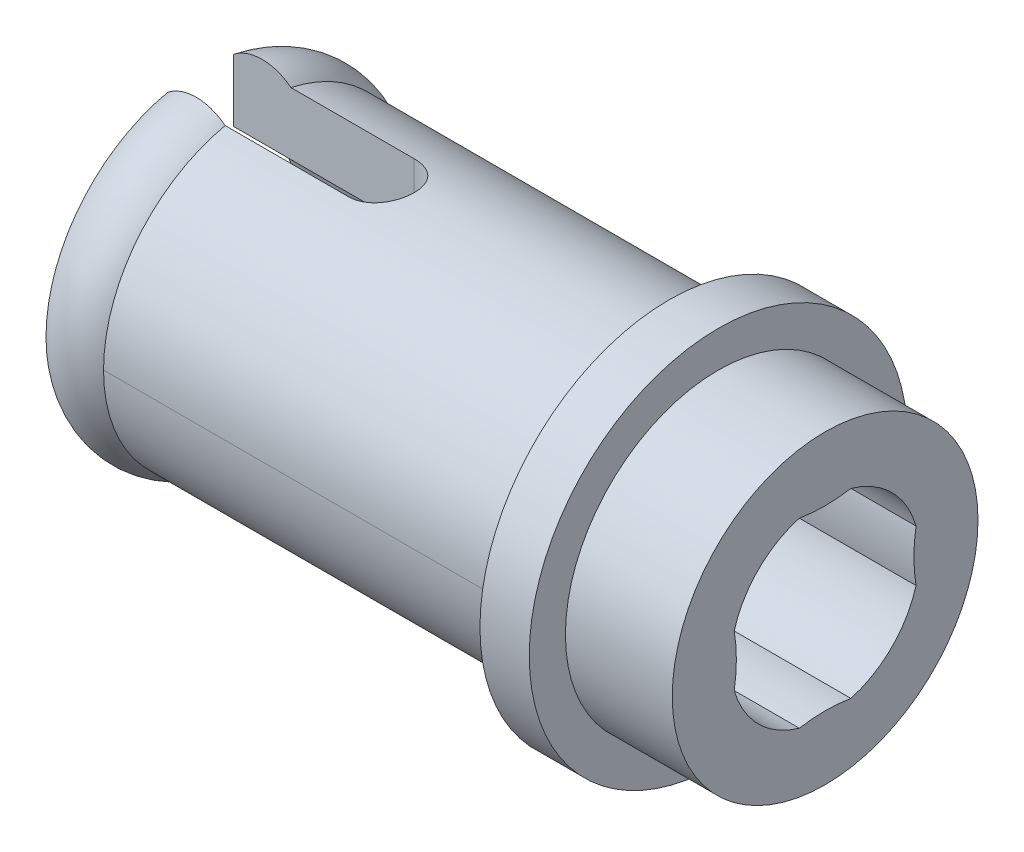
from build123d import *

# Parameters (mm, degrees)
SKETCH1_R               = 2.3622
BASE_EXTRUDE_DEPTH      = 1.651
SKETCH3_R               = 2.921
BOSS_EXTRUDE1_DEPTH     = 0.762
SKETCH4_R               = 2.3876
BOSS_EXTRUDE2_DEPTH     = 7.239
SKETCH7_R               = 1.4605
CUT_EXTRUDE2_DEPTH      = 11.498837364
CUT_EXTRUDE4_DEPTH      = 10.004470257
CUT_EXTRUDE4_DEPTH_BACK = 10.004470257
BOSS_EXTRUDE11_START    = -3.937
BOSS_EXTRUDE11_DEPTH    = 3.937
CIRPATTERN1_COUNT       = 4


with BuildPart() as part:
    # Sketch1 → Base-Extrude (new body)
    with BuildSketch(Plane(origin=(0, 0, 0), x_dir=(0, 0, -1), z_dir=(1, 0, 0))):
        with Locations(Location((0, 0, 0), (0, 0, 180))):
            Circle(SKETCH1_R)
    extrude(amount=BASE_EXTRUDE_DEPTH)

    # Sketch3 → Boss-Extrude1 (add)
    with BuildSketch(Plane.ZY):
        with Locations(Location((0, 0, 0), (0, 0, 180))):
            Circle(SKETCH3_R)
    extrude(amount=BOSS_EXTRUDE1_DEPTH)

    # Sketch4 → Boss-Extrude2 (add)
    with BuildSketch(Plane.ZY.offset(0.762)):
        Circle(SKETCH4_R)
    extrude(amount=BOSS_EXTRUDE2_DEPTH)

    # Sketch6 → Boss-Revolve2 (revolve)
    with BuildSketch(Plane(origin=(0, 0, 0), x_dir=(1, 0, 0), z_dir=(0, 1, 0)), mode=Mode.PRIVATE) as boss_revolve2_sk:
        with BuildLine():
            Line((-8.001, 2.3876), (-7.112, 2.3876))
            ThreePointArc((-7.112, 2.3876), (-7.5565, 2.54), (-8.001, 2.3876))
        make_face()
    revolve(boss_revolve2_sk.sketch.rotate(Axis((0, 0, 0), (-1, 0, 0)), 180), axis=Axis((0, 0, 0), (-1, 0, 0)))

    # Sketch7 → Cut-Extrude2 (cut, through all)
    with BuildSketch(Plane.ZY.offset(8.001)):
        Circle(SKETCH7_R)
    extrude(amount=-CUT_EXTRUDE2_DEPTH, mode=Mode.SUBTRACT)

    # Sketch8 → Cut-Extrude4 (cut, two sides: drawn at the far end of the back side and taken through both)
    with BuildSketch(Plane(origin=(0, 0, 0), x_dir=(1, 0, 0), z_dir=(0, 1, 0)).offset(-CUT_EXTRUDE4_DEPTH_BACK)):
        with BuildLine():
            Line((-8.001, 0.508), (-5.207, 0.508))
            ThreePointArc((-5.207, 0.508), (-4.699, 0), (-5.207, -0.508))
            Line((-5.207, -0.508), (-8.001, -0.508))
            Line((-8.001, -0.508), (-8.001, 0.508))
        make_face()
    extrude(amount=CUT_EXTRUDE4_DEPTH + CUT_EXTRUDE4_DEPTH_BACK, mode=Mode.SUBTRACT)

    # Sketch11 → Boss-Extrude11 (add)
    with BuildSketch(Plane(origin=(1.651, 0, 0), x_dir=(0, 0, -1), z_dir=(1, 0, 0)).offset(BOSS_EXTRUDE11_START)):
        with BuildLine():
            ThreePointArc((0.39848324, 1.405087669), (0, 1.4605), (-0.39848324, 1.405087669))
            ThreePointArc((-0.39848324, 1.405087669), (0, 1.3716), (0.39848324, 1.405087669))
        make_face()
    boss_extrude11 = extrude(amount=BOSS_EXTRUDE11_DEPTH)

    # CirPattern1: Boss-Extrude11 ×4 about axis
    cirpattern1_axis = Axis((0, 0, 0), (1, 0, 0))
    for i in range(1, CIRPATTERN1_COUNT):
        add(boss_extrude11.rotate(cirpattern1_axis, i * 360 / CIRPATTERN1_COUNT))


solid = part.part
